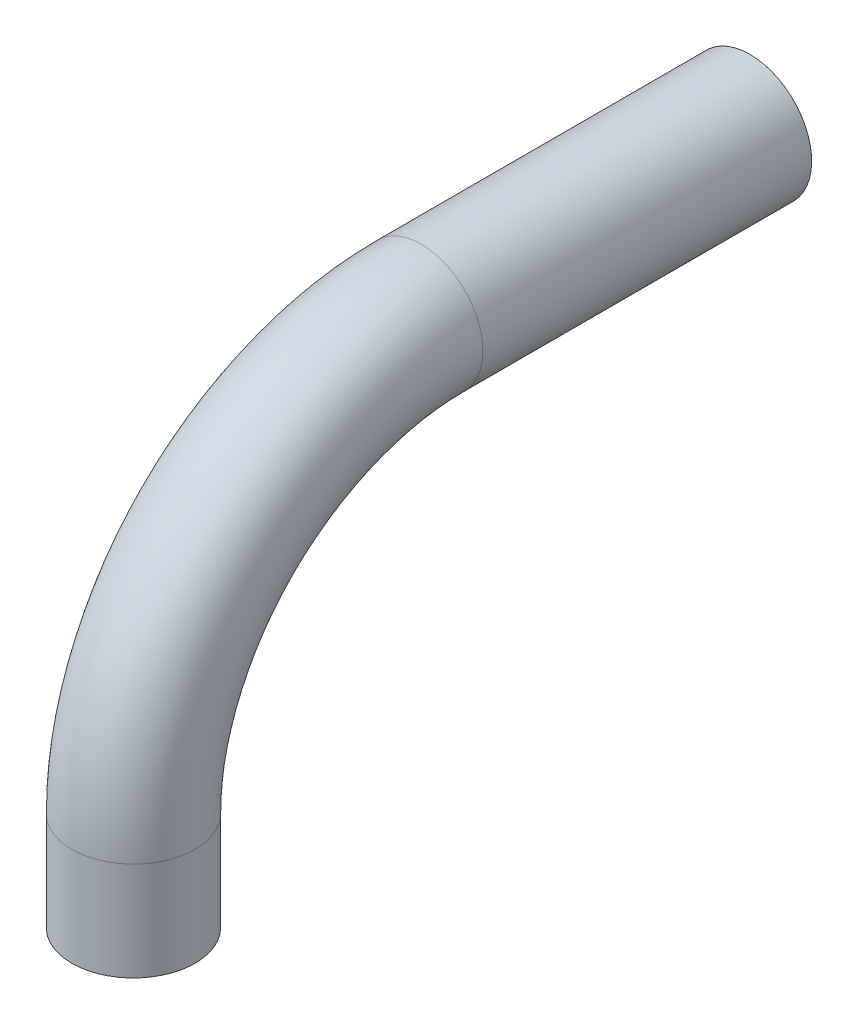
ISO-10303-21;
HEADER;
FILE_DESCRIPTION(('STEP AP214'),'2;1');
FILE_NAME('part.step','',(''),(''),'','','');
FILE_SCHEMA(('AUTOMOTIVE_DESIGN { 1 0 10303 214 1 1 1 1 }'));
ENDSEC;
DATA;
#1=APPLICATION_CONTEXT('core data for automotive mechanical design processes');
#2=APPLICATION_PROTOCOL_DEFINITION('international standard','automotive_design',2000,#1);
#3=PRODUCT_CONTEXT('',#1,'mechanical');
#4=PRODUCT('Part','Part','',(#3));
#5=PRODUCT_RELATED_PRODUCT_CATEGORY('part','',(#4));
#6=PRODUCT_DEFINITION_FORMATION('','',#4);
#7=PRODUCT_DEFINITION_CONTEXT('part definition',#1,'design');
#8=PRODUCT_DEFINITION('design','',#6,#7);
#9=PRODUCT_DEFINITION_SHAPE('','',#8);
#10=(LENGTH_UNIT() NAMED_UNIT(*) SI_UNIT(.MILLI.,.METRE.));
#11=(NAMED_UNIT(*) PLANE_ANGLE_UNIT() SI_UNIT($,.RADIAN.));
#12=(NAMED_UNIT(*) SI_UNIT($,.STERADIAN.) SOLID_ANGLE_UNIT());
#13=UNCERTAINTY_MEASURE_WITH_UNIT(LENGTH_MEASURE(1.E-05),#10,'distance_accuracy_value','');
#14=(GEOMETRIC_REPRESENTATION_CONTEXT(3) GLOBAL_UNCERTAINTY_ASSIGNED_CONTEXT((#13)) GLOBAL_UNIT_ASSIGNED_CONTEXT((#10,
#11,#12)) REPRESENTATION_CONTEXT('',''));
#15=CARTESIAN_POINT('',(0.,0.,0.));
#16=DIRECTION('',(0.,0.,1.));
#17=DIRECTION('',(1.,0.,0.));
#18=AXIS2_PLACEMENT_3D('',#15,#16,#17);
#19=CARTESIAN_POINT('',(0.,14.9225,-11.1125));
#20=DIRECTION('',(0.,0.,-1.));
#21=DIRECTION('',(-1.,0.,0.));
#22=AXIS2_PLACEMENT_3D('',#19,#20,#21);
#23=CYLINDRICAL_SURFACE('',#22,2.38125);
#24=CARTESIAN_POINT('',(0.,14.9225,-11.1125));
#25=DIRECTION('',(0.,0.,-1.));
#26=DIRECTION('',(0.,1.,0.));
#27=AXIS2_PLACEMENT_3D('',#24,#25,#26);
#28=CIRCLE('',#27,2.38125);
#29=CARTESIAN_POINT('',(0.,17.30375,-11.1125));
#30=VERTEX_POINT('',#29);
#31=EDGE_CURVE('E44',#30,#30,#28,.T.);
#32=ORIENTED_EDGE('',*,*,#31,.T.);
#33=EDGE_LOOP('',(#32));
#34=FACE_BOUND('',#33,.T.);
#35=CARTESIAN_POINT('',(0.,14.9225,-23.8125));
#36=DIRECTION('',(0.,0.,-1.));
#37=DIRECTION('',(0.,1.,0.));
#38=AXIS2_PLACEMENT_3D('',#35,#36,#37);
#39=CIRCLE('',#38,2.38125);
#40=CARTESIAN_POINT('',(0.,17.30375,-23.8125));
#41=VERTEX_POINT('',#40);
#42=EDGE_CURVE('E10',#41,#41,#39,.T.);
#43=ORIENTED_EDGE('',*,*,#42,.F.);
#44=EDGE_LOOP('',(#43));
#45=FACE_BOUND('',#44,.T.);
#46=ADVANCED_FACE('F34',(#34,#45),#23,.T.);
#47=CARTESIAN_POINT('',(0.,14.9225,-11.1125));
#48=DIRECTION('',(0.,0.,-1.));
#49=DIRECTION('',(-1.,0.,0.));
#50=AXIS2_PLACEMENT_3D('',#47,#48,#49);
#51=CYLINDRICAL_SURFACE('',#50,1.778);
#52=CARTESIAN_POINT('',(0.,14.9225,-11.1125));
#53=DIRECTION('',(0.,0.,-1.));
#54=DIRECTION('',(0.,1.,0.));
#55=AXIS2_PLACEMENT_3D('',#52,#53,#54);
#56=CIRCLE('',#55,1.778);
#57=CARTESIAN_POINT('',(0.,16.7005,-11.1125));
#58=VERTEX_POINT('',#57);
#59=EDGE_CURVE('E48',#58,#58,#56,.T.);
#60=ORIENTED_EDGE('',*,*,#59,.F.);
#61=EDGE_LOOP('',(#60));
#62=FACE_BOUND('',#61,.T.);
#63=CARTESIAN_POINT('',(0.,14.9225,-23.8125));
#64=DIRECTION('',(0.,0.,-1.));
#65=DIRECTION('',(0.,1.,0.));
#66=AXIS2_PLACEMENT_3D('',#63,#64,#65);
#67=CIRCLE('',#66,1.778);
#68=CARTESIAN_POINT('',(0.,16.7005,-23.8125));
#69=VERTEX_POINT('',#68);
#70=EDGE_CURVE('E40',#69,#69,#67,.T.);
#71=ORIENTED_EDGE('',*,*,#70,.T.);
#72=EDGE_LOOP('',(#71));
#73=FACE_BOUND('',#72,.T.);
#74=ADVANCED_FACE('F86',(#62,#73),#51,.F.);
#75=CARTESIAN_POINT('',(0.,3.81,-11.1125));
#76=DIRECTION('',(-1.,0.,0.));
#77=DIRECTION('',(0.,0.,1.));
#78=AXIS2_PLACEMENT_3D('',#75,#76,#77);
#79=TOROIDAL_SURFACE('',#78,11.1125,2.38125);
#80=CARTESIAN_POINT('',(0.,3.81,0.));
#81=DIRECTION('',(0.,1.,0.));
#82=DIRECTION('',(0.,0.,1.));
#83=AXIS2_PLACEMENT_3D('',#80,#81,#82);
#84=CIRCLE('',#83,2.38125);
#85=CARTESIAN_POINT('',(0.,3.81,2.38125));
#86=VERTEX_POINT('',#85);
#87=EDGE_CURVE('E53',#86,#86,#84,.T.);
#88=CARTESIAN_POINT('',(0.,3.81,-11.1125));
#89=DIRECTION('',(-1.,0.,0.));
#90=DIRECTION('',(0.,0.,1.));
#91=AXIS2_PLACEMENT_3D('',#88,#89,#90);
#92=CIRCLE('',#91,13.49375);
#93=EDGE_CURVE('',#86,#30,#92,.T.);
#94=ORIENTED_EDGE('',*,*,#87,.T.);
#95=ORIENTED_EDGE('',*,*,#31,.F.);
#96=ORIENTED_EDGE('',*,*,#93,.T.);
#97=ORIENTED_EDGE('',*,*,#93,.F.);
#98=EDGE_LOOP('',(#94,#96,#95,#97));
#99=FACE_BOUND('',#98,.T.);
#100=ADVANCED_FACE('F82',(#99),#79,.T.);
#101=CARTESIAN_POINT('',(0.,3.81,-11.1125));
#102=DIRECTION('',(-1.,0.,0.));
#103=DIRECTION('',(0.,0.,1.));
#104=AXIS2_PLACEMENT_3D('',#101,#102,#103);
#105=TOROIDAL_SURFACE('',#104,11.1125,1.778);
#106=CARTESIAN_POINT('',(0.,3.81,0.));
#107=DIRECTION('',(0.,1.,0.));
#108=DIRECTION('',(0.,0.,1.));
#109=AXIS2_PLACEMENT_3D('',#106,#107,#108);
#110=CIRCLE('',#109,1.778);
#111=CARTESIAN_POINT('',(0.,3.81,1.778));
#112=VERTEX_POINT('',#111);
#113=EDGE_CURVE('E56',#112,#112,#110,.T.);
#114=CARTESIAN_POINT('',(0.,3.81,-11.1125));
#115=DIRECTION('',(-1.,0.,0.));
#116=DIRECTION('',(0.,0.,1.));
#117=AXIS2_PLACEMENT_3D('',#114,#115,#116);
#118=CIRCLE('',#117,12.8905);
#119=EDGE_CURVE('',#112,#58,#118,.T.);
#120=ORIENTED_EDGE('',*,*,#113,.F.);
#121=ORIENTED_EDGE('',*,*,#59,.T.);
#122=ORIENTED_EDGE('',*,*,#119,.T.);
#123=ORIENTED_EDGE('',*,*,#119,.F.);
#124=EDGE_LOOP('',(#120,#122,#121,#123));
#125=FACE_BOUND('',#124,.T.);
#126=ADVANCED_FACE('F72',(#125),#105,.F.);
#127=CARTESIAN_POINT('',(0.,3.81,0.));
#128=DIRECTION('',(0.,-1.,0.));
#129=DIRECTION('',(0.,0.,-1.));
#130=AXIS2_PLACEMENT_3D('',#127,#128,#129);
#131=CYLINDRICAL_SURFACE('',#130,1.778);
#132=ORIENTED_EDGE('',*,*,#113,.T.);
#133=EDGE_LOOP('',(#132));
#134=FACE_BOUND('',#133,.T.);
#135=CARTESIAN_POINT('',(0.,0.,0.));
#136=DIRECTION('',(0.,1.,0.));
#137=DIRECTION('',(0.,0.,1.));
#138=AXIS2_PLACEMENT_3D('',#135,#136,#137);
#139=CIRCLE('',#138,1.778);
#140=CARTESIAN_POINT('',(0.,0.,1.778));
#141=VERTEX_POINT('',#140);
#142=EDGE_CURVE('E62',#141,#141,#139,.T.);
#143=ORIENTED_EDGE('',*,*,#142,.F.);
#144=EDGE_LOOP('',(#143));
#145=FACE_BOUND('',#144,.T.);
#146=ADVANCED_FACE('F69',(#134,#145),#131,.F.);
#147=CARTESIAN_POINT('',(0.,3.81,0.));
#148=DIRECTION('',(0.,-1.,0.));
#149=DIRECTION('',(0.,0.,-1.));
#150=AXIS2_PLACEMENT_3D('',#147,#148,#149);
#151=CYLINDRICAL_SURFACE('',#150,2.38125);
#152=ORIENTED_EDGE('',*,*,#87,.F.);
#153=EDGE_LOOP('',(#152));
#154=FACE_BOUND('',#153,.T.);
#155=CARTESIAN_POINT('',(0.,0.,0.));
#156=DIRECTION('',(0.,1.,0.));
#157=DIRECTION('',(0.,0.,1.));
#158=AXIS2_PLACEMENT_3D('',#155,#156,#157);
#159=CIRCLE('',#158,2.38125);
#160=CARTESIAN_POINT('',(0.,0.,2.38125));
#161=VERTEX_POINT('',#160);
#162=EDGE_CURVE('E59',#161,#161,#159,.T.);
#163=ORIENTED_EDGE('',*,*,#162,.T.);
#164=EDGE_LOOP('',(#163));
#165=FACE_BOUND('',#164,.T.);
#166=ADVANCED_FACE('F71',(#154,#165),#151,.T.);
#167=CARTESIAN_POINT('',(0.,14.9225,-23.8125));
#168=DIRECTION('',(0.,0.,-1.));
#169=DIRECTION('',(0.,1.,0.));
#170=AXIS2_PLACEMENT_3D('',#167,#168,#169);
#171=PLANE('',#170);
#172=ORIENTED_EDGE('',*,*,#70,.F.);
#173=EDGE_LOOP('',(#172));
#174=FACE_BOUND('',#173,.T.);
#175=ORIENTED_EDGE('',*,*,#42,.T.);
#176=EDGE_LOOP('',(#175));
#177=FACE_BOUND('',#176,.T.);
#178=ADVANCED_FACE('F79',(#174,#177),#171,.T.);
#179=CARTESIAN_POINT('',(0.,0.,0.));
#180=DIRECTION('',(0.,1.,0.));
#181=DIRECTION('',(0.,0.,1.));
#182=AXIS2_PLACEMENT_3D('',#179,#180,#181);
#183=PLANE('',#182);
#184=ORIENTED_EDGE('',*,*,#142,.T.);
#185=EDGE_LOOP('',(#184));
#186=FACE_BOUND('',#185,.T.);
#187=ORIENTED_EDGE('',*,*,#162,.F.);
#188=EDGE_LOOP('',(#187));
#189=FACE_BOUND('',#188,.T.);
#190=ADVANCED_FACE('F66',(#186,#189),#183,.F.);
#191=CLOSED_SHELL('',(#46,#74,#100,#126,#146,#166,#178,#190));
#192=MANIFOLD_SOLID_BREP('B2',#191);
#193=ADVANCED_BREP_SHAPE_REPRESENTATION('',(#18,#192),#14);
#194=SHAPE_DEFINITION_REPRESENTATION(#9,#193);
ENDSEC;
END-ISO-10303-21;
